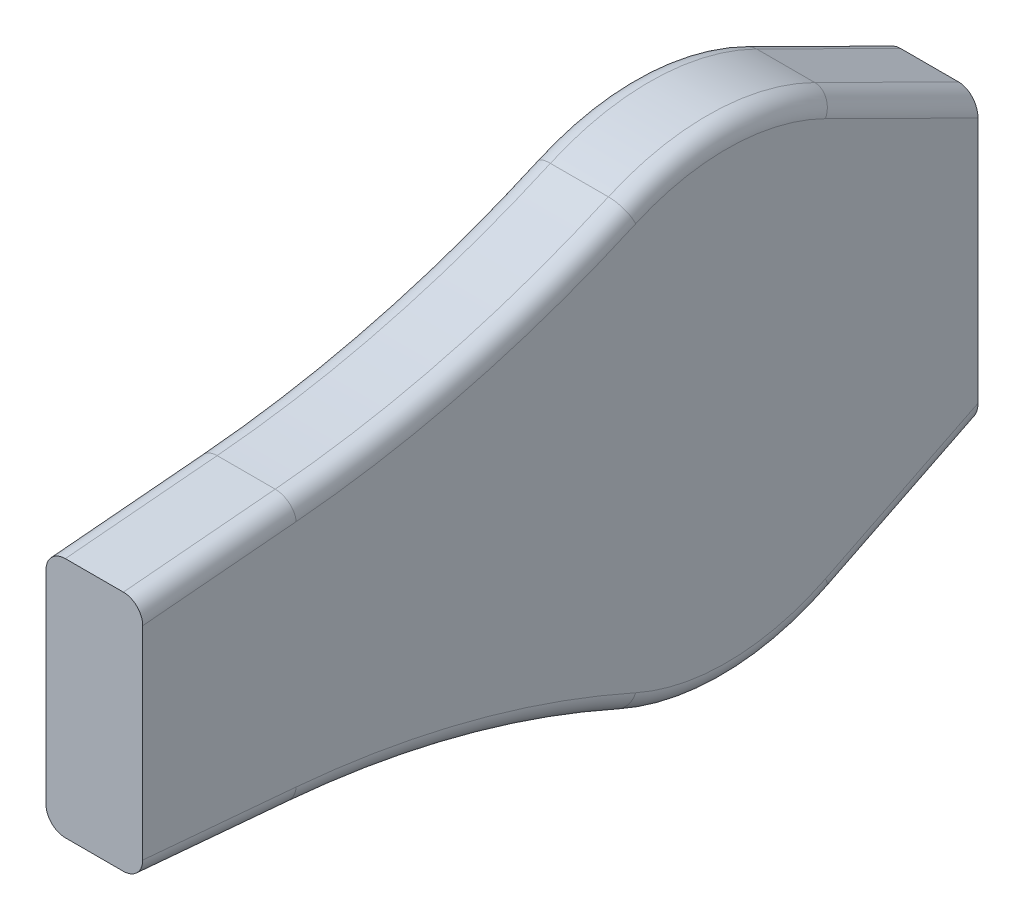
from build123d import *

# Parameters (mm, degrees)
BOSS_EXTRUDE1_DEPTH      = 1
BOSS_EXTRUDE1_DEPTH_BACK = 4
FILLET1_R                = 1


with BuildPart() as part:
    # Sketch1 → Boss-Extrude1 (new, two sides: drawn at the far end of the back side and taken through both)
    with BuildSketch(Plane(origin=(0, 0, 0), x_dir=(0, 0, -1), z_dir=(1, 0, 0)).offset(-BOSS_EXTRUDE1_DEPTH_BACK)):
        with BuildLine():
            Line((-30.18, 6.25), (-30.18, -6.25))
            Line((-30.18, -6.25), (-22.331287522, -6.936673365))
            ThreePointArc((-22.331287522, -6.936673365), (-13.532020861, -8.4531096), (-5.106612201, -11.409316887))
            ThreePointArc((-5.106612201, -11.409316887), (0.250947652, -12.497480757), (5.560506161, -11.195122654))
            Line((5.560506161, -11.195122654), (13, -7.5))
            Line((13, -7.5), (13, 7.5))
            Line((13, 7.5), (5.560506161, 11.195122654))
            ThreePointArc((5.560506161, 11.195122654), (0.250947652, 12.497480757), (-5.106612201, 11.409316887))
            ThreePointArc((-5.106612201, 11.409316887), (-13.532020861, 8.4531096), (-22.331287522, 6.936673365))
            Line((-22.331287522, 6.936673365), (-30.18, 6.25))
        make_face()
    extrude(amount=BOSS_EXTRUDE1_DEPTH + BOSS_EXTRUDE1_DEPTH_BACK)

    # Fillet1
    fillet1_edges = [part.edges().sort_by_distance(p)[0] for p in [
        (1, -6.593336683, 26.255643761),
        (1, -8.4531096, 13.532020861),
        (1, -12.497480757, -0.250947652),
        (1, -9.347561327, -9.280253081),
        (-4, 6.593336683, 26.255643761),
        (-4, 8.4531096, 13.532020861),
        (-4, 12.497480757, -0.250947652),
        (-4, 9.347561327, -9.280253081),
        (-4, -9.347561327, -9.280253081),
        (-4, -12.497480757, -0.250947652),
        (-4, -8.4531096, 13.532020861),
        (-4, -6.593336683, 26.255643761),
        (1, 9.347561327, -9.280253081),
        (1, 12.497480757, -0.250947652),
        (1, 8.4531096, 13.532020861),
        (1, 6.593336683, 26.255643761),
    ]]
    fillet(fillet1_edges, radius=FILLET1_R)


solid = part.part
